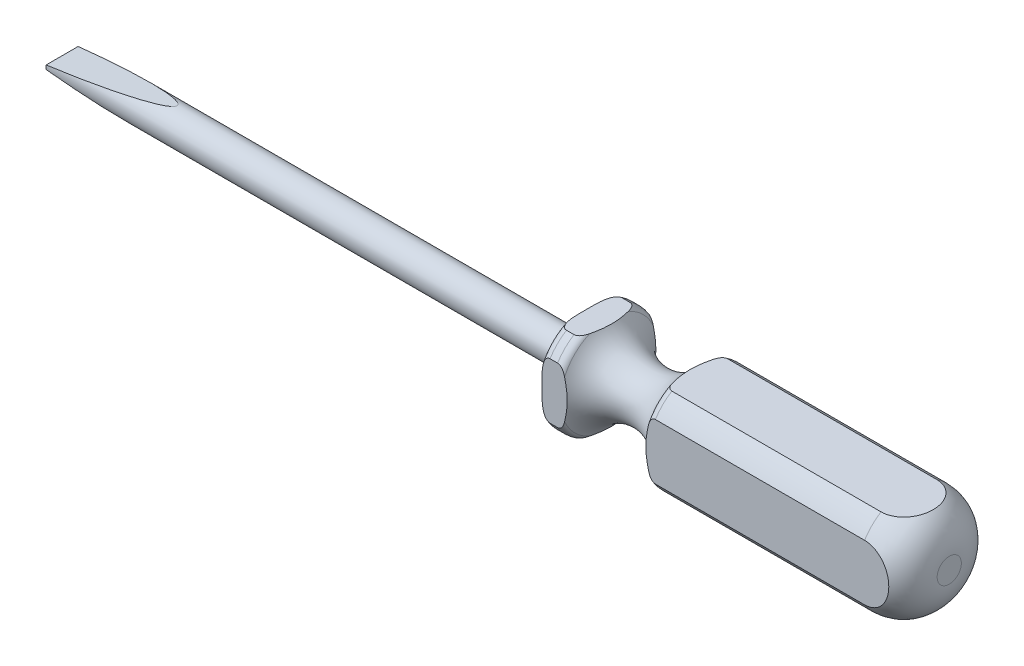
from build123d import *

# Parameters (mm, degrees)
CUT_EXTRUDE1_DEPTH      = 141.186946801
CUT_EXTRUDE1_DEPTH_BACK = 141.186946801
CUT_EXTRUDE2_REACH      = 142.187
SKETCH3_W               = 12.7
SKETCH3_H               = 3.175
SKETCH3_W_2             = 3.175
SKETCH3_H_2             = 12.7


with BuildPart() as part:
    # Sketch1 → Revolve1 (revolve)
    with BuildSketch(Plane.XY, mode=Mode.PRIVATE) as revolve1_sk:
        with BuildLine():
            Line((0, 0), (0, 1.905))
            ThreePointArc((0, 1.905), (-1.859871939, 6.395128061), (-6.35, 8.255))
            Line((-6.35, 8.255), (-39.29103416, 8.255))
            ThreePointArc((-39.29103416, 8.255), (-39.92603416, 8.084852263), (-40.390886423, 7.62))
            ThreePointArc((-40.390886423, 7.62), (-46.99, 3.81), (-53.589113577, 7.62))
            ThreePointArc((-53.589113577, 7.62), (-54.05396584, 8.084852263), (-54.68896584, 8.255))
            Line((-54.68896584, 8.255), (-55.88, 8.255))
            ThreePointArc((-55.88, 8.255), (-56.778025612, 7.883025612), (-57.15, 6.985))
            Line((-57.15, 6.985), (-57.15, 2.54))
            Line((-57.15, 2.54), (-139.7, 2.54))
            Line((-139.7, 2.54), (-139.7, 0))
            Line((-139.7, 0), (0, 0))
        make_face()
    revolve(revolve1_sk.sketch.rotate(Axis((0, 0, 0), (-1, 0, 0)), 90), axis=Axis((0, 0, 0), (-1, 0, 0)))

    # Sketch2 → Cut-Extrude1 (cut, two sides: drawn at the far end of the back side and taken through both)
    with BuildSketch(Plane.XY.offset(-CUT_EXTRUDE1_DEPTH_BACK)):
        Polygon((130.661206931, 33.513682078), (-121.599190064, 2.54), (-139.7, 0.3175), (-139.7, -0.3175), (-121.599190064, -2.54), (130.661206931, -33.513682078), (-377.648450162, -33.513682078), (-377.648450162, 33.513682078), align=None)
    extrude(amount=CUT_EXTRUDE1_DEPTH + CUT_EXTRUDE1_DEPTH_BACK, mode=Mode.SUBTRACT)

    # Cut-Extrude2: up to this face of the body (flat: up to its plane)
    cut_extrude2_end = Plane(part.part.faces().sort_by_distance((-57.15, 0, 6.787434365))[0])
    # Sketch3 → Cut-Extrude2 (cut, up to the picked face)
    with BuildSketch(Plane(origin=(0, 0, 0), x_dir=(0, 0, -1), z_dir=(1, 0, 0)), mode=Mode.PRIVATE) as cut_extrude2_sk1:
        with Locations((0, -8.5725)):
            Rectangle(SKETCH3_W, SKETCH3_H)
    cut_extrude2_tool1 = split(extrude(cut_extrude2_sk1.sketch, amount=-CUT_EXTRUDE2_REACH, mode=Mode.PRIVATE), bisect_by=cut_extrude2_end, keep=Keep.BOTH, mode=Mode.PRIVATE)
    # Sketch3 → Cut-Extrude2 (cut, up to the picked face)
    with BuildSketch(Plane(origin=(0, 0, 0), x_dir=(0, 0, -1), z_dir=(1, 0, 0)), mode=Mode.PRIVATE) as cut_extrude2_sk2:
        with Locations((0, 8.5725)):
            Rectangle(SKETCH3_W, SKETCH3_H)
    cut_extrude2_tool2 = split(extrude(cut_extrude2_sk2.sketch, amount=-CUT_EXTRUDE2_REACH, mode=Mode.PRIVATE), bisect_by=cut_extrude2_end, keep=Keep.BOTH, mode=Mode.PRIVATE)
    # Sketch3 → Cut-Extrude2 (cut, up to the picked face)
    with BuildSketch(Plane(origin=(0, 0, 0), x_dir=(0, 0, -1), z_dir=(1, 0, 0)), mode=Mode.PRIVATE) as cut_extrude2_sk3:
        with Locations((-8.5725, 0)):
            Rectangle(SKETCH3_W_2, SKETCH3_H_2)
    cut_extrude2_tool3 = split(extrude(cut_extrude2_sk3.sketch, amount=-CUT_EXTRUDE2_REACH, mode=Mode.PRIVATE), bisect_by=cut_extrude2_end, keep=Keep.BOTH, mode=Mode.PRIVATE)
    # Sketch3 → Cut-Extrude2 (cut, up to the picked face)
    with BuildSketch(Plane(origin=(0, 0, 0), x_dir=(0, 0, -1), z_dir=(1, 0, 0)), mode=Mode.PRIVATE) as cut_extrude2_sk4:
        with Locations((8.5725, 0)):
            Rectangle(SKETCH3_W_2, SKETCH3_H_2)
    cut_extrude2_tool4 = split(extrude(cut_extrude2_sk4.sketch, amount=-CUT_EXTRUDE2_REACH, mode=Mode.PRIVATE), bisect_by=cut_extrude2_end, keep=Keep.BOTH, mode=Mode.PRIVATE)
    add(cut_extrude2_tool1.solids().sort_by(Axis((0, -8.5725, 0), (-1, 0, 0)))[0], mode=Mode.SUBTRACT)
    add(cut_extrude2_tool2.solids().sort_by(Axis((0, 8.5725, 0), (-1, 0, 0)))[0], mode=Mode.SUBTRACT)
    add(cut_extrude2_tool3.solids().sort_by(Axis((0, 0, 8.5725), (-1, 0, 0)))[0], mode=Mode.SUBTRACT)
    add(cut_extrude2_tool4.solids().sort_by(Axis((0, 0, -8.5725), (-1, 0, 0)))[0], mode=Mode.SUBTRACT)


solid = part.part
